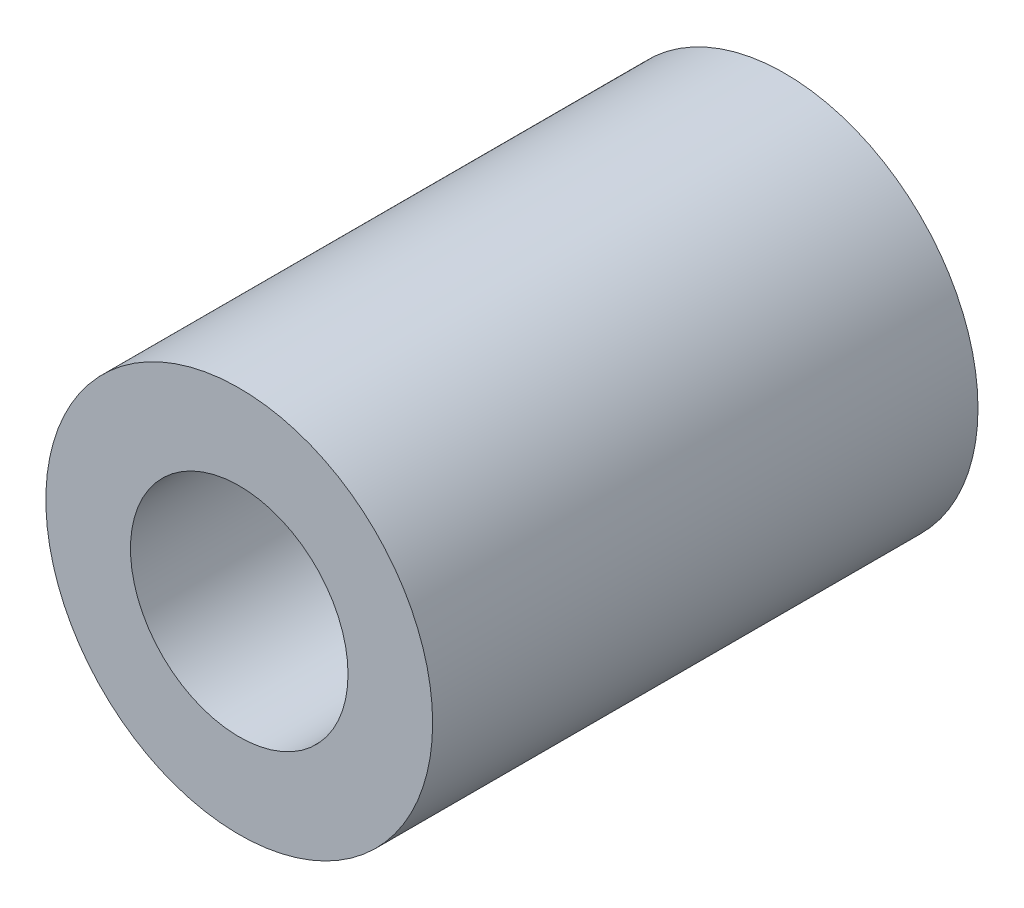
from build123d import *

# Parameters (mm, degrees)
SKETCH1_R           = 3.175
SKETCH1_R_2         = 1.7859375
BOSS_EXTRUDE1_DEPTH = 4.47675


with BuildPart() as part:
    # Sketch1 → Boss-Extrude1 (new, symmetric)
    with BuildSketch(Plane.XY):
        Circle(SKETCH1_R)
        Circle(SKETCH1_R_2, mode=Mode.SUBTRACT)
    extrude(amount=BOSS_EXTRUDE1_DEPTH, both=True)


solid = part.part
